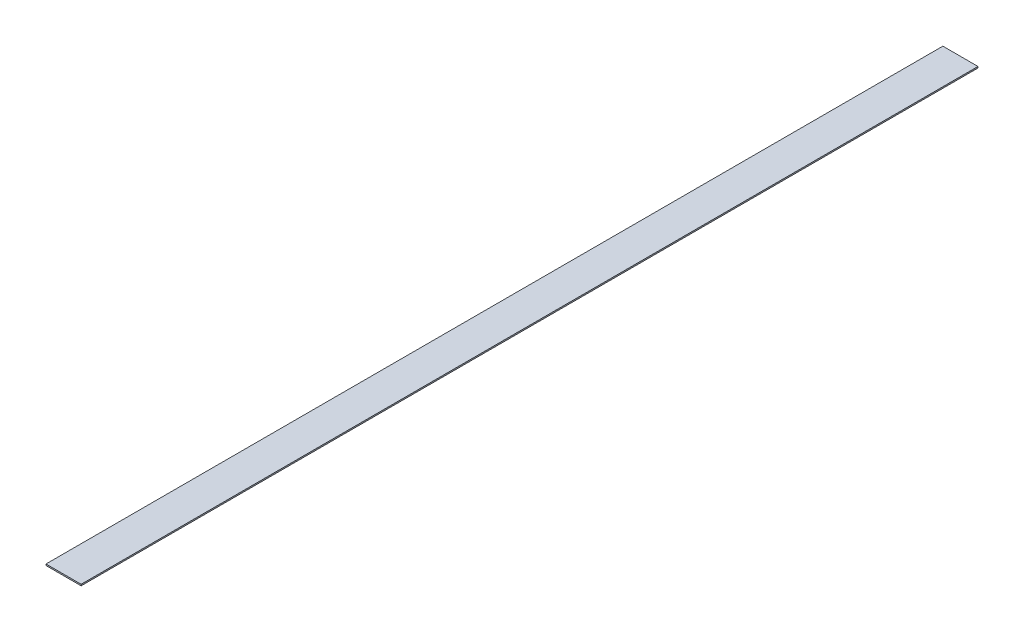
from build123d import *

# Parameters (mm, degrees)
SKETCH1_W           = 38
SKETCH1_H           = 970
BOSS_EXTRUDE1_DEPTH = 1.5


with BuildPart() as part:
    # Sketch1 → Boss-Extrude1 (new body)
    with BuildSketch(Plane(origin=(0, 0, 0), x_dir=(1, 0, 0), z_dir=(0, 1, 0))):
        with Locations((19, 485)):
            Rectangle(SKETCH1_W, SKETCH1_H)
    extrude(amount=BOSS_EXTRUDE1_DEPTH)


solid = part.part
